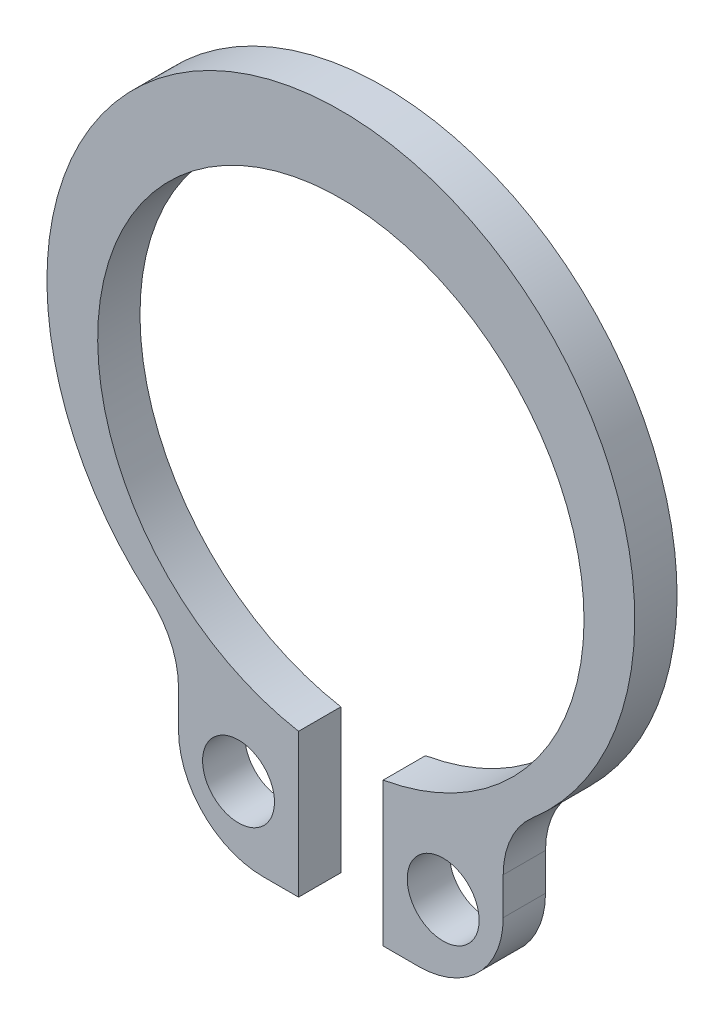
ISO-10303-21;
HEADER;
FILE_DESCRIPTION(('STEP AP214'),'2;1');
FILE_NAME('part.step','',(''),(''),'','','');
FILE_SCHEMA(('AUTOMOTIVE_DESIGN { 1 0 10303 214 1 1 1 1 }'));
ENDSEC;
DATA;
#1=APPLICATION_CONTEXT('core data for automotive mechanical design processes');
#2=APPLICATION_PROTOCOL_DEFINITION('international standard','automotive_design',2000,#1);
#3=PRODUCT_CONTEXT('',#1,'mechanical');
#4=PRODUCT('Part','Part','',(#3));
#5=PRODUCT_RELATED_PRODUCT_CATEGORY('part','',(#4));
#6=PRODUCT_DEFINITION_FORMATION('','',#4);
#7=PRODUCT_DEFINITION_CONTEXT('part definition',#1,'design');
#8=PRODUCT_DEFINITION('design','',#6,#7);
#9=PRODUCT_DEFINITION_SHAPE('','',#8);
#10=(LENGTH_UNIT() NAMED_UNIT(*) SI_UNIT(.MILLI.,.METRE.));
#11=(NAMED_UNIT(*) PLANE_ANGLE_UNIT() SI_UNIT($,.RADIAN.));
#12=(NAMED_UNIT(*) SI_UNIT($,.STERADIAN.) SOLID_ANGLE_UNIT());
#13=UNCERTAINTY_MEASURE_WITH_UNIT(LENGTH_MEASURE(1.E-05),#10,'distance_accuracy_value','');
#14=(GEOMETRIC_REPRESENTATION_CONTEXT(3) GLOBAL_UNCERTAINTY_ASSIGNED_CONTEXT((#13)) GLOBAL_UNIT_ASSIGNED_CONTEXT((#10,
#11,#12)) REPRESENTATION_CONTEXT('',''));
#15=CARTESIAN_POINT('',(0.,0.,0.));
#16=DIRECTION('',(0.,0.,1.));
#17=DIRECTION('',(1.,0.,0.));
#18=AXIS2_PLACEMENT_3D('',#15,#16,#17);
#19=CARTESIAN_POINT('',(-5.83914123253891,-6.18284082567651,1.));
#20=DIRECTION('',(0.,0.,-1.));
#21=DIRECTION('',(-1.,0.,0.));
#22=AXIS2_PLACEMENT_3D('',#19,#20,#21);
#23=CYLINDRICAL_SURFACE('',#22,2.);
#24=CARTESIAN_POINT('',(-5.83914123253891,-6.18284082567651,0.));
#25=DIRECTION('',(0.,0.,1.));
#26=DIRECTION('',(0.,1.,0.));
#27=AXIS2_PLACEMENT_3D('',#24,#25,#26);
#28=CIRCLE('',#27,2.);
#29=CARTESIAN_POINT('',(-3.83914123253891,-6.18284082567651,0.));
#30=VERTEX_POINT('',#29);
#31=CARTESIAN_POINT('',(-4.53430520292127,-4.66712220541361,0.));
#32=VERTEX_POINT('',#31);
#33=EDGE_CURVE('E125',#30,#32,#28,.T.);
#34=ORIENTED_EDGE('',*,*,#33,.F.);
#35=DIRECTION('',(0.,0.,-1.));
#36=VECTOR('',#35,1.);
#37=CARTESIAN_POINT('',(-3.83914123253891,-6.18284082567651,1.));
#38=LINE('',#37,#36);
#39=CARTESIAN_POINT('',(-3.83914123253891,-6.18284082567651,1.));
#40=VERTEX_POINT('',#39);
#41=EDGE_CURVE('E30',#40,#30,#38,.T.);
#42=ORIENTED_EDGE('',*,*,#41,.F.);
#43=CARTESIAN_POINT('',(-5.83914123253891,-6.18284082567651,1.));
#44=DIRECTION('',(0.,0.,1.));
#45=DIRECTION('',(0.,1.,0.));
#46=AXIS2_PLACEMENT_3D('',#43,#44,#45);
#47=CIRCLE('',#46,2.);
#48=CARTESIAN_POINT('',(-4.53430520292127,-4.66712220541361,1.));
#49=VERTEX_POINT('',#48);
#50=EDGE_CURVE('E155',#40,#49,#47,.T.);
#51=ORIENTED_EDGE('',*,*,#50,.T.);
#52=DIRECTION('',(0.,0.,-1.));
#53=VECTOR('',#52,1.);
#54=CARTESIAN_POINT('',(-4.53430520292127,-4.66712220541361,1.));
#55=LINE('',#54,#53);
#56=EDGE_CURVE('E11',#49,#32,#55,.T.);
#57=ORIENTED_EDGE('',*,*,#56,.T.);
#58=EDGE_LOOP('',(#34,#42,#51,#57));
#59=FACE_BOUND('',#58,.T.);
#60=ADVANCED_FACE('F16',(#59),#23,.F.);
#61=CARTESIAN_POINT('',(0.,0.6,1.));
#62=DIRECTION('',(0.,0.,-1.));
#63=DIRECTION('',(-1.,0.,0.));
#64=AXIS2_PLACEMENT_3D('',#61,#62,#63);
#65=CYLINDRICAL_SURFACE('',#64,6.95);
#66=CARTESIAN_POINT('',(0.,0.6,0.));
#67=DIRECTION('',(0.,0.,1.));
#68=DIRECTION('',(0.,1.,0.));
#69=AXIS2_PLACEMENT_3D('',#66,#67,#68);
#70=CIRCLE('',#69,6.95);
#71=CARTESIAN_POINT('',(4.53430520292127,-4.66712220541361,0.));
#72=VERTEX_POINT('',#71);
#73=EDGE_CURVE('E107',#72,#32,#70,.T.);
#74=ORIENTED_EDGE('',*,*,#73,.T.);
#75=ORIENTED_EDGE('',*,*,#56,.F.);
#76=CARTESIAN_POINT('',(0.,0.6,1.));
#77=DIRECTION('',(0.,0.,1.));
#78=DIRECTION('',(0.,1.,0.));
#79=AXIS2_PLACEMENT_3D('',#76,#77,#78);
#80=CIRCLE('',#79,6.95);
#81=CARTESIAN_POINT('',(4.53430520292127,-4.66712220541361,1.));
#82=VERTEX_POINT('',#81);
#83=EDGE_CURVE('E110',#82,#49,#80,.T.);
#84=ORIENTED_EDGE('',*,*,#83,.F.);
#85=DIRECTION('',(0.,0.,-1.));
#86=VECTOR('',#85,1.);
#87=CARTESIAN_POINT('',(4.53430520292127,-4.66712220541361,1.));
#88=LINE('',#87,#86);
#89=EDGE_CURVE('E19',#82,#72,#88,.T.);
#90=ORIENTED_EDGE('',*,*,#89,.T.);
#91=EDGE_LOOP('',(#74,#75,#84,#90));
#92=FACE_BOUND('',#91,.T.);
#93=ADVANCED_FACE('F105',(#92),#65,.T.);
#94=CARTESIAN_POINT('',(5.83914123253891,-6.18284082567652,1.));
#95=DIRECTION('',(0.,0.,-1.));
#96=DIRECTION('',(-1.,0.,0.));
#97=AXIS2_PLACEMENT_3D('',#94,#95,#96);
#98=CYLINDRICAL_SURFACE('',#97,2.);
#99=CARTESIAN_POINT('',(5.83914123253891,-6.18284082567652,0.));
#100=DIRECTION('',(0.,0.,1.));
#101=DIRECTION('',(0.,1.,0.));
#102=AXIS2_PLACEMENT_3D('',#99,#100,#101);
#103=CIRCLE('',#102,2.);
#104=CARTESIAN_POINT('',(3.8391412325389,-6.18284082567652,0.));
#105=VERTEX_POINT('',#104);
#106=EDGE_CURVE('E116',#72,#105,#103,.T.);
#107=ORIENTED_EDGE('',*,*,#106,.F.);
#108=ORIENTED_EDGE('',*,*,#89,.F.);
#109=CARTESIAN_POINT('',(5.83914123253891,-6.18284082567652,1.));
#110=DIRECTION('',(0.,0.,1.));
#111=DIRECTION('',(0.,1.,0.));
#112=AXIS2_PLACEMENT_3D('',#109,#110,#111);
#113=CIRCLE('',#112,2.);
#114=CARTESIAN_POINT('',(3.8391412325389,-6.18284082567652,1.));
#115=VERTEX_POINT('',#114);
#116=EDGE_CURVE('E158',#82,#115,#113,.T.);
#117=ORIENTED_EDGE('',*,*,#116,.T.);
#118=DIRECTION('',(0.,0.,-1.));
#119=VECTOR('',#118,1.);
#120=CARTESIAN_POINT('',(3.8391412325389,-6.18284082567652,1.));
#121=LINE('',#120,#119);
#122=EDGE_CURVE('E114',#115,#105,#121,.T.);
#123=ORIENTED_EDGE('',*,*,#122,.T.);
#124=EDGE_LOOP('',(#107,#108,#117,#123));
#125=FACE_BOUND('',#124,.T.);
#126=ADVANCED_FACE('F117',(#125),#98,.F.);
#127=CARTESIAN_POINT('',(3.8391412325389,-7.06,1.));
#128=DIRECTION('',(-1.,0.,0.));
#129=DIRECTION('',(0.,-1.,0.));
#130=AXIS2_PLACEMENT_3D('',#127,#128,#129);
#131=PLANE('',#130);
#132=DIRECTION('',(0.,1.,0.));
#133=VECTOR('',#132,1.);
#134=CARTESIAN_POINT('',(3.8391412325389,-7.06,0.));
#135=LINE('',#134,#133);
#136=CARTESIAN_POINT('',(3.8391412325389,-7.06,0.));
#137=VERTEX_POINT('',#136);
#138=EDGE_CURVE('E121',#137,#105,#135,.T.);
#139=ORIENTED_EDGE('',*,*,#138,.T.);
#140=ORIENTED_EDGE('',*,*,#122,.F.);
#141=DIRECTION('',(0.,1.,0.));
#142=VECTOR('',#141,1.);
#143=CARTESIAN_POINT('',(3.8391412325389,-7.06,1.));
#144=LINE('',#143,#142);
#145=CARTESIAN_POINT('',(3.8391412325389,-7.06,1.));
#146=VERTEX_POINT('',#145);
#147=EDGE_CURVE('E160',#146,#115,#144,.T.);
#148=ORIENTED_EDGE('',*,*,#147,.F.);
#149=DIRECTION('',(0.,0.,-1.));
#150=VECTOR('',#149,1.);
#151=CARTESIAN_POINT('',(3.8391412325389,-7.06,1.));
#152=LINE('',#151,#150);
#153=EDGE_CURVE('E202',#146,#137,#152,.T.);
#154=ORIENTED_EDGE('',*,*,#153,.T.);
#155=EDGE_LOOP('',(#139,#140,#148,#154));
#156=FACE_BOUND('',#155,.T.);
#157=ADVANCED_FACE('F206',(#156),#131,.F.);
#158=CARTESIAN_POINT('',(1.83914123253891,-7.06,1.));
#159=DIRECTION('',(0.,0.,-1.));
#160=DIRECTION('',(-1.,0.,0.));
#161=AXIS2_PLACEMENT_3D('',#158,#159,#160);
#162=CYLINDRICAL_SURFACE('',#161,2.);
#163=CARTESIAN_POINT('',(1.83914123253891,-7.06,0.));
#164=DIRECTION('',(0.,0.,1.));
#165=DIRECTION('',(0.,1.,0.));
#166=AXIS2_PLACEMENT_3D('',#163,#164,#165);
#167=CIRCLE('',#166,2.);
#168=CARTESIAN_POINT('',(1.83914123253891,-9.06,0.));
#169=VERTEX_POINT('',#168);
#170=EDGE_CURVE('E133',#169,#137,#167,.T.);
#171=ORIENTED_EDGE('',*,*,#170,.T.);
#172=ORIENTED_EDGE('',*,*,#153,.F.);
#173=CARTESIAN_POINT('',(1.83914123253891,-7.06,1.));
#174=DIRECTION('',(0.,0.,1.));
#175=DIRECTION('',(0.,1.,0.));
#176=AXIS2_PLACEMENT_3D('',#173,#174,#175);
#177=CIRCLE('',#176,2.);
#178=CARTESIAN_POINT('',(1.83914123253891,-9.06,1.));
#179=VERTEX_POINT('',#178);
#180=EDGE_CURVE('E163',#179,#146,#177,.T.);
#181=ORIENTED_EDGE('',*,*,#180,.F.);
#182=DIRECTION('',(0.,0.,-1.));
#183=VECTOR('',#182,1.);
#184=CARTESIAN_POINT('',(1.83914123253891,-9.06,1.));
#185=LINE('',#184,#183);
#186=EDGE_CURVE('E200',#179,#169,#185,.T.);
#187=ORIENTED_EDGE('',*,*,#186,.T.);
#188=EDGE_LOOP('',(#171,#172,#181,#187));
#189=FACE_BOUND('',#188,.T.);
#190=ADVANCED_FACE('F210',(#189),#162,.T.);
#191=CARTESIAN_POINT('',(1.,-9.06,1.));
#192=DIRECTION('',(0.,1.,0.));
#193=DIRECTION('',(-1.,0.,0.));
#194=AXIS2_PLACEMENT_3D('',#191,#192,#193);
#195=PLANE('',#194);
#196=DIRECTION('',(1.,0.,0.));
#197=VECTOR('',#196,1.);
#198=CARTESIAN_POINT('',(1.,-9.06,0.));
#199=LINE('',#198,#197);
#200=CARTESIAN_POINT('',(1.,-9.06,0.));
#201=VERTEX_POINT('',#200);
#202=EDGE_CURVE('E136',#201,#169,#199,.T.);
#203=ORIENTED_EDGE('',*,*,#202,.T.);
#204=ORIENTED_EDGE('',*,*,#186,.F.);
#205=DIRECTION('',(1.,0.,0.));
#206=VECTOR('',#205,1.);
#207=CARTESIAN_POINT('',(1.,-9.06,1.));
#208=LINE('',#207,#206);
#209=CARTESIAN_POINT('',(1.,-9.06,1.));
#210=VERTEX_POINT('',#209);
#211=EDGE_CURVE('E166',#210,#179,#208,.T.);
#212=ORIENTED_EDGE('',*,*,#211,.F.);
#213=DIRECTION('',(0.,0.,-1.));
#214=VECTOR('',#213,1.);
#215=CARTESIAN_POINT('',(1.,-9.06,1.));
#216=LINE('',#215,#214);
#217=EDGE_CURVE('E198',#210,#201,#216,.T.);
#218=ORIENTED_EDGE('',*,*,#217,.T.);
#219=EDGE_LOOP('',(#203,#204,#212,#218));
#220=FACE_BOUND('',#219,.T.);
#221=ADVANCED_FACE('F214',(#220),#195,.F.);
#222=CARTESIAN_POINT('',(1.,-9.06,1.));
#223=DIRECTION('',(-1.,0.,0.));
#224=DIRECTION('',(0.,-1.,0.));
#225=AXIS2_PLACEMENT_3D('',#222,#223,#224);
#226=PLANE('',#225);
#227=DIRECTION('',(0.,1.,0.));
#228=VECTOR('',#227,1.);
#229=CARTESIAN_POINT('',(1.,-9.06,0.));
#230=LINE('',#229,#228);
#231=CARTESIAN_POINT('',(1.,-5.66237582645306,0.));
#232=VERTEX_POINT('',#231);
#233=EDGE_CURVE('E139',#201,#232,#230,.T.);
#234=ORIENTED_EDGE('',*,*,#233,.F.);
#235=ORIENTED_EDGE('',*,*,#217,.F.);
#236=DIRECTION('',(0.,1.,0.));
#237=VECTOR('',#236,1.);
#238=CARTESIAN_POINT('',(1.,-9.06,1.));
#239=LINE('',#238,#237);
#240=CARTESIAN_POINT('',(1.,-5.66237582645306,1.));
#241=VERTEX_POINT('',#240);
#242=EDGE_CURVE('E169',#210,#241,#239,.T.);
#243=ORIENTED_EDGE('',*,*,#242,.T.);
#244=DIRECTION('',(0.,0.,-1.));
#245=VECTOR('',#244,1.);
#246=CARTESIAN_POINT('',(1.,-5.66237582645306,1.));
#247=LINE('',#246,#245);
#248=EDGE_CURVE('E196',#241,#232,#247,.T.);
#249=ORIENTED_EDGE('',*,*,#248,.T.);
#250=EDGE_LOOP('',(#234,#235,#243,#249));
#251=FACE_BOUND('',#250,.T.);
#252=ADVANCED_FACE('F218',(#251),#226,.T.);
#253=CARTESIAN_POINT('',(0.,0.,1.));
#254=DIRECTION('',(0.,0.,-1.));
#255=DIRECTION('',(-1.,0.,0.));
#256=AXIS2_PLACEMENT_3D('',#253,#254,#255);
#257=CYLINDRICAL_SURFACE('',#256,5.75);
#258=CARTESIAN_POINT('',(0.,0.,0.));
#259=DIRECTION('',(0.,0.,1.));
#260=DIRECTION('',(0.,1.,0.));
#261=AXIS2_PLACEMENT_3D('',#258,#259,#260);
#262=CIRCLE('',#261,5.75);
#263=CARTESIAN_POINT('',(-1.,-5.66237582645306,0.));
#264=VERTEX_POINT('',#263);
#265=EDGE_CURVE('E142',#232,#264,#262,.T.);
#266=ORIENTED_EDGE('',*,*,#265,.F.);
#267=ORIENTED_EDGE('',*,*,#248,.F.);
#268=CARTESIAN_POINT('',(0.,0.,1.));
#269=DIRECTION('',(0.,0.,1.));
#270=DIRECTION('',(0.,1.,0.));
#271=AXIS2_PLACEMENT_3D('',#268,#269,#270);
#272=CIRCLE('',#271,5.75);
#273=CARTESIAN_POINT('',(-1.,-5.66237582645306,1.));
#274=VERTEX_POINT('',#273);
#275=EDGE_CURVE('E172',#241,#274,#272,.T.);
#276=ORIENTED_EDGE('',*,*,#275,.T.);
#277=DIRECTION('',(0.,0.,-1.));
#278=VECTOR('',#277,1.);
#279=CARTESIAN_POINT('',(-1.,-5.66237582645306,1.));
#280=LINE('',#279,#278);
#281=EDGE_CURVE('E194',#274,#264,#280,.T.);
#282=ORIENTED_EDGE('',*,*,#281,.T.);
#283=EDGE_LOOP('',(#266,#267,#276,#282));
#284=FACE_BOUND('',#283,.T.);
#285=ADVANCED_FACE('F222',(#284),#257,.F.);
#286=CARTESIAN_POINT('',(-1.,-9.06,1.));
#287=DIRECTION('',(-1.,0.,0.));
#288=DIRECTION('',(0.,-1.,0.));
#289=AXIS2_PLACEMENT_3D('',#286,#287,#288);
#290=PLANE('',#289);
#291=DIRECTION('',(0.,1.,0.));
#292=VECTOR('',#291,1.);
#293=CARTESIAN_POINT('',(-1.,-9.06,0.));
#294=LINE('',#293,#292);
#295=CARTESIAN_POINT('',(-1.,-9.06,0.));
#296=VERTEX_POINT('',#295);
#297=EDGE_CURVE('E145',#296,#264,#294,.T.);
#298=ORIENTED_EDGE('',*,*,#297,.T.);
#299=ORIENTED_EDGE('',*,*,#281,.F.);
#300=DIRECTION('',(0.,1.,0.));
#301=VECTOR('',#300,1.);
#302=CARTESIAN_POINT('',(-1.,-9.06,1.));
#303=LINE('',#302,#301);
#304=CARTESIAN_POINT('',(-1.,-9.06,1.));
#305=VERTEX_POINT('',#304);
#306=EDGE_CURVE('E175',#305,#274,#303,.T.);
#307=ORIENTED_EDGE('',*,*,#306,.F.);
#308=DIRECTION('',(0.,0.,-1.));
#309=VECTOR('',#308,1.);
#310=CARTESIAN_POINT('',(-1.,-9.06,1.));
#311=LINE('',#310,#309);
#312=EDGE_CURVE('E192',#305,#296,#311,.T.);
#313=ORIENTED_EDGE('',*,*,#312,.T.);
#314=EDGE_LOOP('',(#298,#299,#307,#313));
#315=FACE_BOUND('',#314,.T.);
#316=ADVANCED_FACE('F227',(#315),#290,.F.);
#317=CARTESIAN_POINT('',(-1.83914123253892,-9.06,1.));
#318=DIRECTION('',(0.,1.,0.));
#319=DIRECTION('',(-1.,0.,0.));
#320=AXIS2_PLACEMENT_3D('',#317,#318,#319);
#321=PLANE('',#320);
#322=DIRECTION('',(1.,0.,0.));
#323=VECTOR('',#322,1.);
#324=CARTESIAN_POINT('',(-1.83914123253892,-9.06,0.));
#325=LINE('',#324,#323);
#326=CARTESIAN_POINT('',(-1.83914123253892,-9.06,0.));
#327=VERTEX_POINT('',#326);
#328=EDGE_CURVE('E148',#327,#296,#325,.T.);
#329=ORIENTED_EDGE('',*,*,#328,.T.);
#330=ORIENTED_EDGE('',*,*,#312,.F.);
#331=DIRECTION('',(1.,0.,0.));
#332=VECTOR('',#331,1.);
#333=CARTESIAN_POINT('',(-1.83914123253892,-9.06,1.));
#334=LINE('',#333,#332);
#335=CARTESIAN_POINT('',(-1.83914123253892,-9.06,1.));
#336=VERTEX_POINT('',#335);
#337=EDGE_CURVE('E178',#336,#305,#334,.T.);
#338=ORIENTED_EDGE('',*,*,#337,.F.);
#339=DIRECTION('',(0.,0.,-1.));
#340=VECTOR('',#339,1.);
#341=CARTESIAN_POINT('',(-1.83914123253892,-9.06,1.));
#342=LINE('',#341,#340);
#343=EDGE_CURVE('E190',#336,#327,#342,.T.);
#344=ORIENTED_EDGE('',*,*,#343,.T.);
#345=EDGE_LOOP('',(#329,#330,#338,#344));
#346=FACE_BOUND('',#345,.T.);
#347=ADVANCED_FACE('F231',(#346),#321,.F.);
#348=CARTESIAN_POINT('',(-1.83914123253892,-7.06,1.));
#349=DIRECTION('',(0.,0.,-1.));
#350=DIRECTION('',(-1.,0.,0.));
#351=AXIS2_PLACEMENT_3D('',#348,#349,#350);
#352=CYLINDRICAL_SURFACE('',#351,2.);
#353=CARTESIAN_POINT('',(-1.83914123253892,-7.06,0.));
#354=DIRECTION('',(0.,0.,1.));
#355=DIRECTION('',(0.,1.,0.));
#356=AXIS2_PLACEMENT_3D('',#353,#354,#355);
#357=CIRCLE('',#356,2.);
#358=CARTESIAN_POINT('',(-3.83914123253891,-7.06,0.));
#359=VERTEX_POINT('',#358);
#360=EDGE_CURVE('E151',#359,#327,#357,.T.);
#361=ORIENTED_EDGE('',*,*,#360,.T.);
#362=ORIENTED_EDGE('',*,*,#343,.F.);
#363=CARTESIAN_POINT('',(-1.83914123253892,-7.06,1.));
#364=DIRECTION('',(0.,0.,1.));
#365=DIRECTION('',(0.,1.,0.));
#366=AXIS2_PLACEMENT_3D('',#363,#364,#365);
#367=CIRCLE('',#366,2.);
#368=CARTESIAN_POINT('',(-3.83914123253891,-7.06,1.));
#369=VERTEX_POINT('',#368);
#370=EDGE_CURVE('E181',#369,#336,#367,.T.);
#371=ORIENTED_EDGE('',*,*,#370,.F.);
#372=DIRECTION('',(0.,0.,-1.));
#373=VECTOR('',#372,1.);
#374=CARTESIAN_POINT('',(-3.83914123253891,-7.06,1.));
#375=LINE('',#374,#373);
#376=EDGE_CURVE('E37',#369,#359,#375,.T.);
#377=ORIENTED_EDGE('',*,*,#376,.T.);
#378=EDGE_LOOP('',(#361,#362,#371,#377));
#379=FACE_BOUND('',#378,.T.);
#380=ADVANCED_FACE('F233',(#379),#352,.T.);
#381=CARTESIAN_POINT('',(-3.83914123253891,-6.18284082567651,1.));
#382=DIRECTION('',(1.,0.,0.));
#383=DIRECTION('',(0.,1.,0.));
#384=AXIS2_PLACEMENT_3D('',#381,#382,#383);
#385=PLANE('',#384);
#386=DIRECTION('',(0.,-1.,0.));
#387=VECTOR('',#386,1.);
#388=CARTESIAN_POINT('',(-3.83914123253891,-6.18284082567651,0.));
#389=LINE('',#388,#387);
#390=EDGE_CURVE('E154',#30,#359,#389,.T.);
#391=ORIENTED_EDGE('',*,*,#390,.T.);
#392=ORIENTED_EDGE('',*,*,#376,.F.);
#393=DIRECTION('',(0.,-1.,0.));
#394=VECTOR('',#393,1.);
#395=CARTESIAN_POINT('',(-3.83914123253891,-6.18284082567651,1.));
#396=LINE('',#395,#394);
#397=EDGE_CURVE('E184',#40,#369,#396,.T.);
#398=ORIENTED_EDGE('',*,*,#397,.F.);
#399=ORIENTED_EDGE('',*,*,#41,.T.);
#400=EDGE_LOOP('',(#391,#392,#398,#399));
#401=FACE_BOUND('',#400,.T.);
#402=ADVANCED_FACE('F237',(#401),#385,.F.);
#403=CARTESIAN_POINT('',(-5.83914123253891,-6.18284082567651,1.));
#404=DIRECTION('',(0.,0.,1.));
#405=DIRECTION('',(1.,0.,0.));
#406=AXIS2_PLACEMENT_3D('',#403,#404,#405);
#407=PLANE('',#406);
#408=CARTESIAN_POINT('',(-2.41957061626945,-7.4,1.));
#409=DIRECTION('',(0.,0.,-1.));
#410=DIRECTION('',(0.,1.,0.));
#411=AXIS2_PLACEMENT_3D('',#408,#409,#410);
#412=CIRCLE('',#411,0.85);
#413=CARTESIAN_POINT('',(-2.41957061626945,-6.55,1.));
#414=VERTEX_POINT('',#413);
#415=EDGE_CURVE('E333',#414,#414,#412,.T.);
#416=ORIENTED_EDGE('',*,*,#415,.T.);
#417=EDGE_LOOP('',(#416));
#418=FACE_BOUND('',#417,.T.);
#419=CARTESIAN_POINT('',(2.41957061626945,-7.4,1.));
#420=DIRECTION('',(0.,0.,-1.));
#421=DIRECTION('',(0.,1.,0.));
#422=AXIS2_PLACEMENT_3D('',#419,#420,#421);
#423=CIRCLE('',#422,0.85);
#424=CARTESIAN_POINT('',(2.41957061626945,-6.55,1.));
#425=VERTEX_POINT('',#424);
#426=EDGE_CURVE('E127',#425,#425,#423,.T.);
#427=ORIENTED_EDGE('',*,*,#426,.T.);
#428=EDGE_LOOP('',(#427));
#429=FACE_BOUND('',#428,.T.);
#430=ORIENTED_EDGE('',*,*,#50,.F.);
#431=ORIENTED_EDGE('',*,*,#397,.T.);
#432=ORIENTED_EDGE('',*,*,#370,.T.);
#433=ORIENTED_EDGE('',*,*,#337,.T.);
#434=ORIENTED_EDGE('',*,*,#306,.T.);
#435=ORIENTED_EDGE('',*,*,#275,.F.);
#436=ORIENTED_EDGE('',*,*,#242,.F.);
#437=ORIENTED_EDGE('',*,*,#211,.T.);
#438=ORIENTED_EDGE('',*,*,#180,.T.);
#439=ORIENTED_EDGE('',*,*,#147,.T.);
#440=ORIENTED_EDGE('',*,*,#116,.F.);
#441=ORIENTED_EDGE('',*,*,#83,.T.);
#442=EDGE_LOOP('',(#430,#431,#432,#433,#434,#435,#436,#437,#438,#439,#440,#441));
#443=FACE_BOUND('',#442,.T.);
#444=ADVANCED_FACE('F236',(#418,#429,#443),#407,.T.);
#445=CARTESIAN_POINT('',(-5.83914123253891,-6.18284082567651,0.));
#446=DIRECTION('',(0.,0.,1.));
#447=DIRECTION('',(1.,0.,0.));
#448=AXIS2_PLACEMENT_3D('',#445,#446,#447);
#449=PLANE('',#448);
#450=CARTESIAN_POINT('',(-2.41957061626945,-7.4,0.));
#451=DIRECTION('',(0.,0.,1.));
#452=DIRECTION('',(0.,1.,0.));
#453=AXIS2_PLACEMENT_3D('',#450,#451,#452);
#454=CIRCLE('',#453,0.85);
#455=CARTESIAN_POINT('',(-2.41957061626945,-6.55,0.));
#456=VERTEX_POINT('',#455);
#457=EDGE_CURVE('E336',#456,#456,#454,.T.);
#458=ORIENTED_EDGE('',*,*,#457,.T.);
#459=EDGE_LOOP('',(#458));
#460=FACE_BOUND('',#459,.T.);
#461=CARTESIAN_POINT('',(2.41957061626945,-7.4,0.));
#462=DIRECTION('',(0.,0.,1.));
#463=DIRECTION('',(0.,1.,0.));
#464=AXIS2_PLACEMENT_3D('',#461,#462,#463);
#465=CIRCLE('',#464,0.85);
#466=CARTESIAN_POINT('',(2.41957061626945,-6.55,0.));
#467=VERTEX_POINT('',#466);
#468=EDGE_CURVE('E338',#467,#467,#465,.T.);
#469=ORIENTED_EDGE('',*,*,#468,.T.);
#470=EDGE_LOOP('',(#469));
#471=FACE_BOUND('',#470,.T.);
#472=ORIENTED_EDGE('',*,*,#33,.T.);
#473=ORIENTED_EDGE('',*,*,#73,.F.);
#474=ORIENTED_EDGE('',*,*,#106,.T.);
#475=ORIENTED_EDGE('',*,*,#138,.F.);
#476=ORIENTED_EDGE('',*,*,#170,.F.);
#477=ORIENTED_EDGE('',*,*,#202,.F.);
#478=ORIENTED_EDGE('',*,*,#233,.T.);
#479=ORIENTED_EDGE('',*,*,#265,.T.);
#480=ORIENTED_EDGE('',*,*,#297,.F.);
#481=ORIENTED_EDGE('',*,*,#328,.F.);
#482=ORIENTED_EDGE('',*,*,#360,.F.);
#483=ORIENTED_EDGE('',*,*,#390,.F.);
#484=EDGE_LOOP('',(#472,#473,#474,#475,#476,#477,#478,#479,#480,#481,#482,#483));
#485=FACE_BOUND('',#484,.T.);
#486=ADVANCED_FACE('F123',(#460,#471,#485),#449,.F.);
#487=CARTESIAN_POINT('',(2.41957061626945,-7.4,0.));
#488=DIRECTION('',(0.,0.,1.));
#489=DIRECTION('',(0.,1.,0.));
#490=AXIS2_PLACEMENT_3D('',#487,#488,#489);
#491=CYLINDRICAL_SURFACE('',#490,0.85);
#492=ORIENTED_EDGE('',*,*,#426,.F.);
#493=EDGE_LOOP('',(#492));
#494=FACE_BOUND('',#493,.T.);
#495=ORIENTED_EDGE('',*,*,#468,.F.);
#496=EDGE_LOOP('',(#495));
#497=FACE_BOUND('',#496,.T.);
#498=ADVANCED_FACE('F305',(#494,#497),#491,.F.);
#499=CARTESIAN_POINT('',(-2.41957061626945,-7.4,0.));
#500=DIRECTION('',(0.,0.,1.));
#501=DIRECTION('',(0.,1.,0.));
#502=AXIS2_PLACEMENT_3D('',#499,#500,#501);
#503=CYLINDRICAL_SURFACE('',#502,0.85);
#504=ORIENTED_EDGE('',*,*,#415,.F.);
#505=EDGE_LOOP('',(#504));
#506=FACE_BOUND('',#505,.T.);
#507=ORIENTED_EDGE('',*,*,#457,.F.);
#508=EDGE_LOOP('',(#507));
#509=FACE_BOUND('',#508,.T.);
#510=ADVANCED_FACE('F315',(#506,#509),#503,.F.);
#511=CLOSED_SHELL('',(#60,#93,#126,#157,#190,#221,#252,#285,#316,#347,#380,#402,#444,#486,#498,#510));
#512=MANIFOLD_SOLID_BREP('B1',#511);
#513=ADVANCED_BREP_SHAPE_REPRESENTATION('',(#18,#512),#14);
#514=SHAPE_DEFINITION_REPRESENTATION(#9,#513);
ENDSEC;
END-ISO-10303-21;
